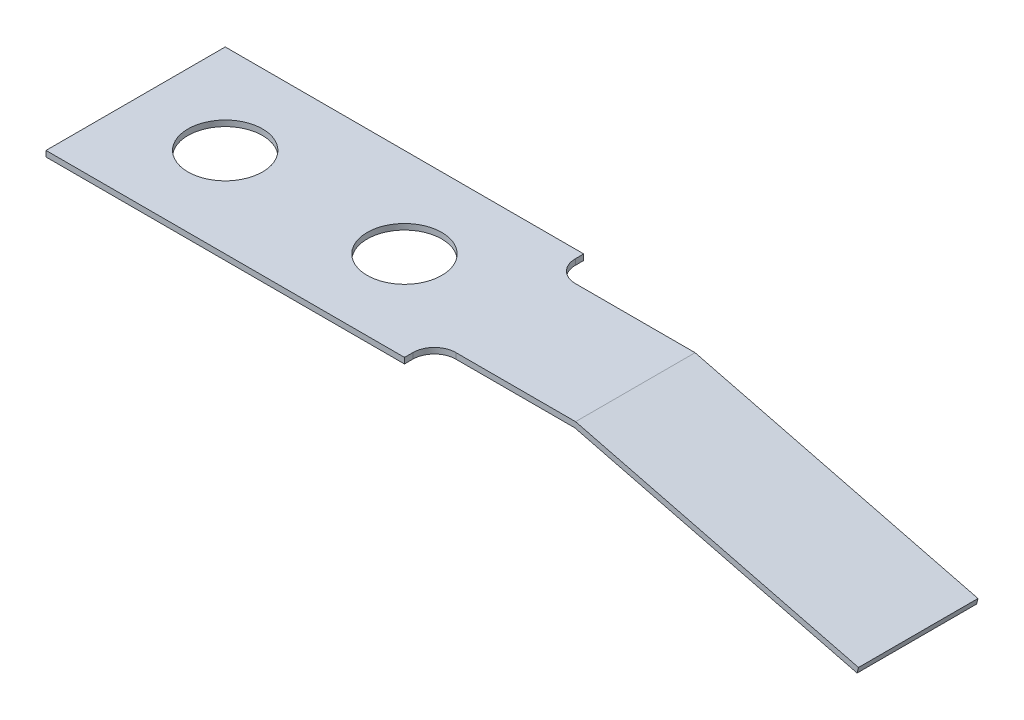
from build123d import *

# Parameters (mm, degrees)
SKETCH1_W           = 19.05
SKETCH1_H           = 9.525
SKETCH1_R           = 1.9812
BOSS_EXTRUDE1_DEPTH = 0.3048
SKETCH4_W           = 7.4676
SKETCH4_H           = 6.35
BOSS_EXTRUDE3_DEPTH = 0.3048
FILLET1_R           = 1.143
BOSS_EXTRUDE4_DEPTH = 6.35


with BuildPart() as part:
    # Sketch1 → Boss-Extrude1 (new body)
    with BuildSketch(Plane(origin=(0, 0, 0), x_dir=(1, 0, 0), z_dir=(0, 1, 0))):
        Rectangle(SKETCH1_W, SKETCH1_H)
        with Locations(Location((-4.7625, 0, 0), (0, 0, 270))):
            Circle(SKETCH1_R, mode=Mode.SUBTRACT)
        with Locations(Location((4.7625, 0, 0), (0, 0, 90))):
            Circle(SKETCH1_R, mode=Mode.SUBTRACT)
    extrude(amount=BOSS_EXTRUDE1_DEPTH)

    # Sketch4 → Boss-Extrude3 (add)
    with BuildSketch(Plane(origin=(0, 0.3048, 0), x_dir=(1, 0, 0), z_dir=(0, 1, 0))):
        with Locations((13.2588, 0)):
            Rectangle(SKETCH4_W, SKETCH4_H)
    extrude(amount=-BOSS_EXTRUDE3_DEPTH)

    # Fillet1
    fillet1_edges = [part.edges().sort_by_distance(p)[0] for p in [
        (9.525, 0.1524, -3.175),
        (9.525, 0.1524, 3.175),
    ]]
    fillet(fillet1_edges, radius=FILLET1_R)

    # Sketch5 → Boss-Extrude4 (add)
    with BuildSketch(Plane(origin=(0, 0, -3.175), x_dir=(-1, 0, 0), z_dir=(0, 0, -1))):
        Polygon((-16.9926, 0), (-31.99107955, -3.7846), (-32.065652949, -3.489063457), (-17.03046205, 0.3048), (-16.9926, 0.3048), align=None)
    extrude(amount=-BOSS_EXTRUDE4_DEPTH)


solid = part.part
